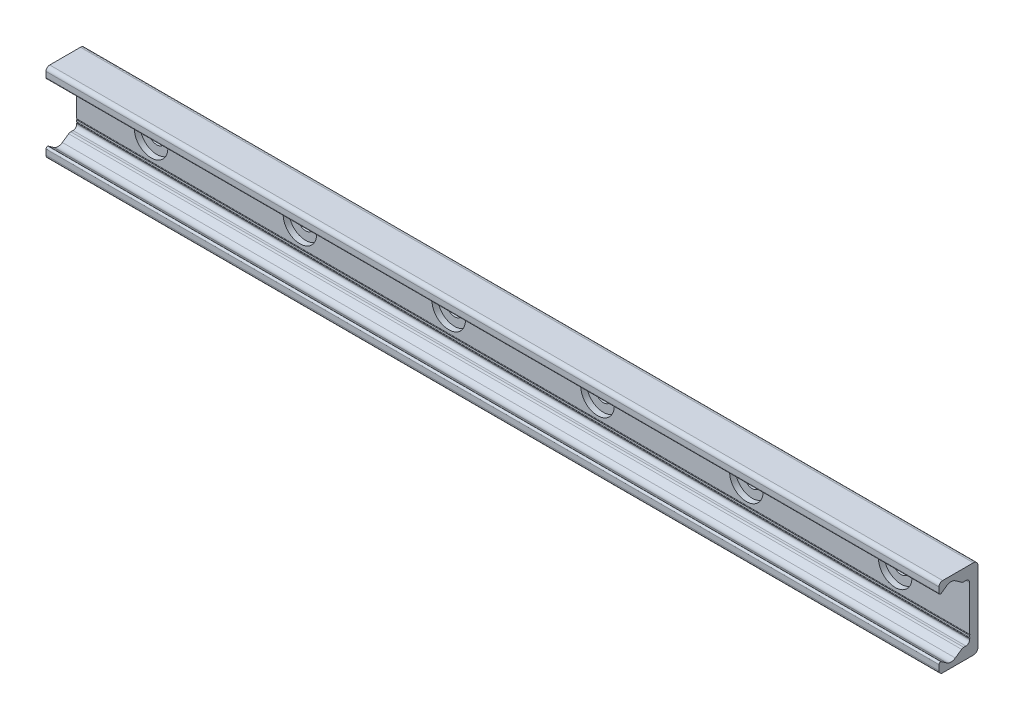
from build123d import *

# Parameters (mm, degrees)
BOSS_EXTRUDE1_DEPTH = 240
SKETCH2_R           = 9
SKETCH2_R_2         = 4.5
CUT_EXTRUDE1_DEPTH  = 3.1
SKETCH2_2_R         = 4.5
CUT_EXTRUDE2_DEPTH  = 242.525360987
LPATTERN1_COUNT     = 6
LPATTERN1_PITCH     = 80


with BuildPart() as part:
    # Sketch1 → Boss-Extrude1 (new, symmetric)
    with BuildSketch(Plane(origin=(0, 0, 0), x_dir=(0, 0, -1), z_dir=(1, 0, 0))):
        with BuildLine():
            Line((0, 0), (0, 19))
            ThreePointArc((0, 19), (-0.732233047, 20.767766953), (-2.5, 21.5))
            Line((-2.5, 21.5), (-19, 21.5))
            ThreePointArc((-19, 21.5), (-20.414213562, 20.914213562), (-21, 19.5))
            Line((-21, 19.5), (-21, 16.625057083))
            ThreePointArc((-21, 16.625057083), (-20.553251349, 15.888838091), (-19.693931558, 15.945160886))
            Line((-19.693931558, 15.945160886), (-16.794305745, 17.975500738))
            ThreePointArc((-16.794305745, 17.975500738), (-14.5, 18.69889256), (-12.205694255, 17.975500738))
            Line((-12.205694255, 17.975500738), (-8.829831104, 15.611695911))
            ThreePointArc((-8.829831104, 15.611695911), (-8.28408983, 15.342566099), (-7.682678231, 15.25))
            Line((-7.682678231, 15.25), (-6.5, 15.25))
            ThreePointArc((-6.5, 15.25), (-5.085786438, 14.664213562), (-4.5, 13.25))
            Line((-4.5, 13.25), (-4.5, -10.75))
            ThreePointArc((-4.5, -10.75), (-4.25, -11), (-4.5, -11.25))
            Line((-4.5, -11.25), (-4.5, -12.25))
            ThreePointArc((-4.5, -12.25), (-4.25, -12.5), (-4.5, -12.75))
            Line((-4.5, -12.75), (-4.5, -13.25))
            ThreePointArc((-4.5, -13.25), (-5.085786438, -14.664213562), (-6.5, -15.25))
            Line((-6.5, -15.25), (-7.682678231, -15.25))
            ThreePointArc((-7.682678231, -15.25), (-8.28408983, -15.342566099), (-8.829831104, -15.611695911))
            Line((-8.829831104, -15.611695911), (-12.205694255, -17.975500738))
            ThreePointArc((-12.205694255, -17.975500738), (-14.5, -18.69889256), (-16.794305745, -17.975500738))
            Line((-16.794305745, -17.975500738), (-19.693931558, -15.945160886))
            ThreePointArc((-19.693931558, -15.945160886), (-20.553251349, -15.888838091), (-21, -16.625057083))
            Line((-21, -16.625057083), (-21, -19.5))
            ThreePointArc((-21, -19.5), (-20.414213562, -20.914213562), (-19, -21.5))
            Line((-19, -21.5), (-2.5, -21.5))
            ThreePointArc((-2.5, -21.5), (-0.732233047, -20.767766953), (0, -19))
            Line((0, -19), (0, 0))
        make_face()
    extrude(amount=BOSS_EXTRUDE1_DEPTH, both=True)

    # Sketch2 → Cut-Extrude1 (cut)
    with BuildSketch(Plane.XY.offset(4.5)):
        with Locations((200, 0)):
            Circle(SKETCH2_R)
        with Locations((200, 0)):
            Circle(SKETCH2_R_2, mode=Mode.SUBTRACT)
    cut_extrude1 = extrude(amount=-CUT_EXTRUDE1_DEPTH, mode=Mode.SUBTRACT)

    # Sketch2_2 → Cut-Extrude2 (cut, through all)
    with BuildSketch(Plane.XY.offset(4.5)):
        with Locations((200, 0)):
            Circle(SKETCH2_2_R)
    cut_extrude2 = extrude(amount=-CUT_EXTRUDE2_DEPTH, mode=Mode.SUBTRACT)

    # LPattern1: Cut-Extrude1, Cut-Extrude2 ×6
    with Locations(*[(-i * LPATTERN1_PITCH, 0, 0) for i in range(1, LPATTERN1_COUNT)]):
        add(cut_extrude1, mode=Mode.SUBTRACT)
        add(cut_extrude2, mode=Mode.SUBTRACT)


solid = part.part
